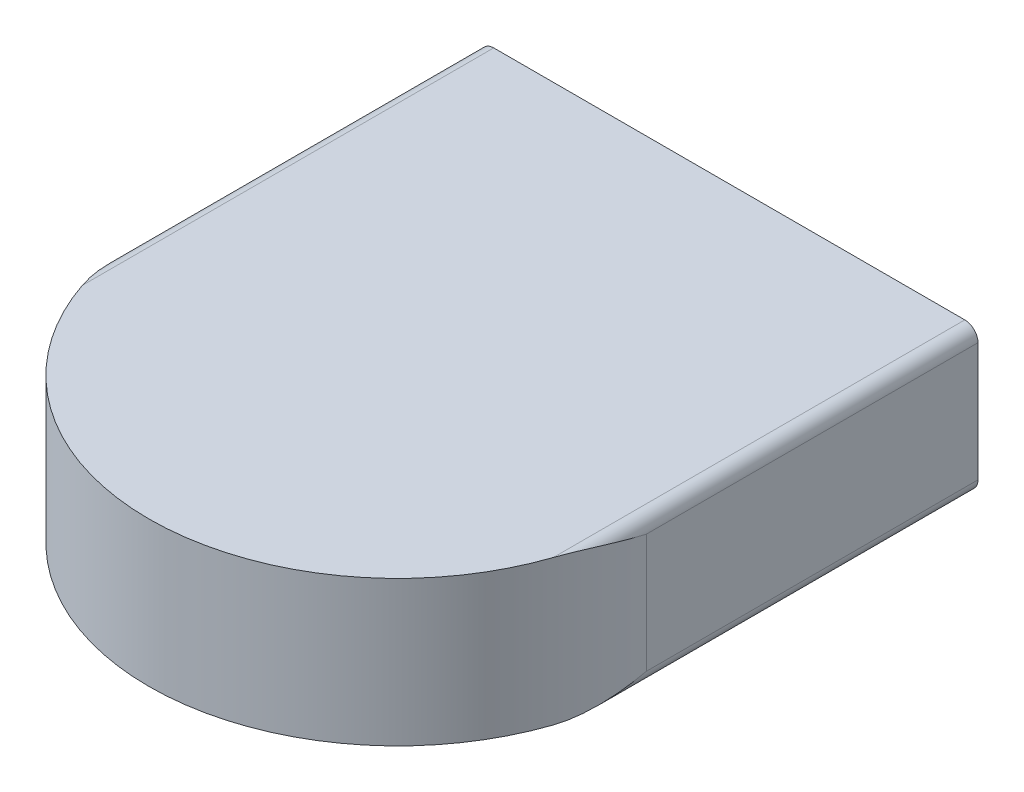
from build123d import *

# Parameters (mm, degrees)
EXTRUDE1_DEPTH     = 8.75
SKETCH2_OUTSIDE_W  = 80.768
SKETCH2_OUTSIDE_H  = 38.268
CUT_EXTRUDE1_DEPTH = 77.658740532


with BuildPart() as part:
    # Sketch1 → Extrude1 (new, symmetric)
    with BuildSketch(Plane(origin=(0, 0, 0), x_dir=(1, 0, 0), z_dir=(0, 1, 0))):
        with BuildLine():
            Line((-30, 40), (30, 40))
            Line((30, 40), (30, 0))
            ThreePointArc((30, 0), (0, -30), (-30, 0))
            Line((-30, 0), (-30, 40))
        make_face()
    extrude(amount=EXTRUDE1_DEPTH, both=True)

    # Sketch2 outside → Cut-Extrude1 (cut, through all)
    with BuildSketch(Plane(origin=(0, 0, -40), x_dir=(-1, 0, 0), z_dir=(0, 0, -1))):
        Rectangle(SKETCH2_OUTSIDE_W, SKETCH2_OUTSIDE_H)
        with BuildLine():
            Line((-28.412, 8.75), (28.412, 8.75))
            ThreePointArc((28.412, 8.75), (29.534885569, 8.284885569), (30, 7.162))
            Line((30, 7.162), (30, -7.162))
            ThreePointArc((30, -7.162), (29.534885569, -8.284885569), (28.412, -8.75))
            Line((28.412, -8.75), (-28.412, -8.75))
            ThreePointArc((-28.412, -8.75), (-29.534885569, -8.284885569), (-30, -7.162))
            Line((-30, -7.162), (-30, 7.162))
            ThreePointArc((-30, 7.162), (-29.534885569, 8.284885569), (-28.412, 8.75))
        make_face(mode=Mode.SUBTRACT)
    extrude(amount=-CUT_EXTRUDE1_DEPTH, mode=Mode.SUBTRACT)


solid = part.part
